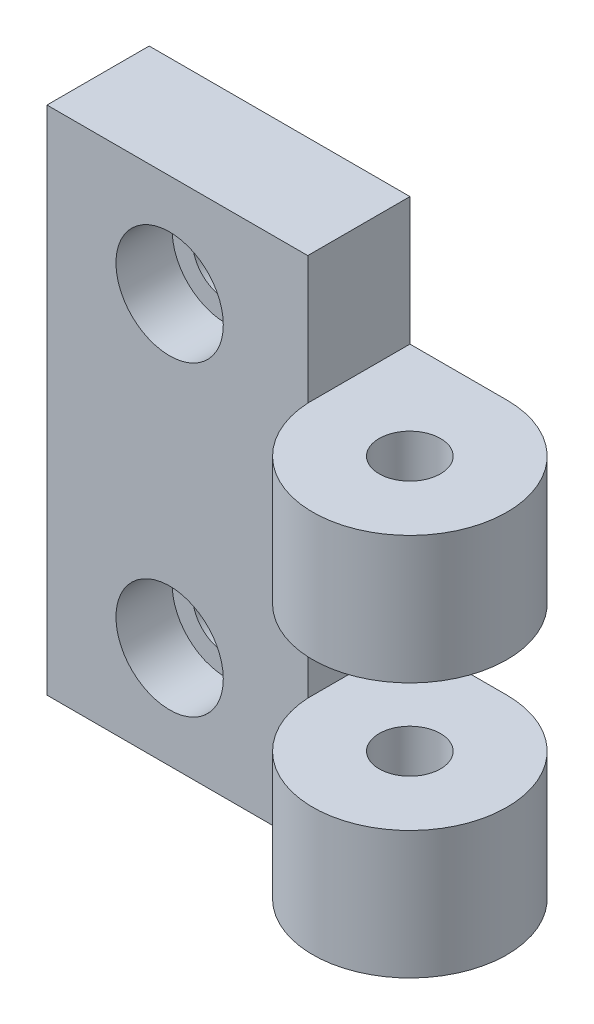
from build123d import *

# Parameters (mm, degrees)
ESQUISSE1_R                                        = 3
EXTRUSION1_DEPTH                                   = 50
ESQUISSE2_W                                        = 18.986832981
ESQUISSE2_H                                        = 12.5
ENL_V_MAT_EXTRU_1_DEPTH                            = 25
CHAMBRAGE_POUR_VIS_T_TE_HEXAGONALE_M61_D           = 6.5
CHAMBRAGE_POUR_VIS_T_TE_HEXAGONALE_M61_CBORE_D     = 10.5
CHAMBRAGE_POUR_VIS_T_TE_HEXAGONALE_M61_CBORE_DEPTH = 5.5


with BuildPart() as part:
    # Esquisse1 → Extrusion1 (new body)
    with BuildSketch(Plane(origin=(0, 0, 0), x_dir=(1, 0, 0), z_dir=(0, 1, 0))):
        with BuildLine():
            Line((0, 0), (25.513167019, 0))
            ThreePointArc((25.513167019, 0), (41.892024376, -6.038348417), (35, 9.999999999))
            Line((35, 9.999999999), (0, 9.999999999))
            Line((0, 9.999999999), (0, 0))
        make_face()
        with Locations(Location((35, 0.499999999, 0), (0, 0, 270))):
            Circle(ESQUISSE1_R, mode=Mode.SUBTRACT)
    extrude(amount=EXTRUSION1_DEPTH)

    # Esquisse2 → Enl_v. mat.-Extru.1 (cut, symmetric)
    with BuildSketch(Plane.XY):
        with Locations((35.00658351, 43.75)):
            Rectangle(ESQUISSE2_W, ESQUISSE2_H)
        with Locations((35.00658351, 18.75)):
            Rectangle(ESQUISSE2_W, ESQUISSE2_H)
    extrude(amount=ENL_V_MAT_EXTRU_1_DEPTH, both=True, mode=Mode.SUBTRACT)

    # Chambrage pour vis _ t_te hexagonale M61 (through all)
    with Locations(Plane.XY):
        with Locations((12, 40), (12, 10)):
            CounterBoreHole(CHAMBRAGE_POUR_VIS_T_TE_HEXAGONALE_M61_D / 2, CHAMBRAGE_POUR_VIS_T_TE_HEXAGONALE_M61_CBORE_D / 2, CHAMBRAGE_POUR_VIS_T_TE_HEXAGONALE_M61_CBORE_DEPTH)


solid = part.part
